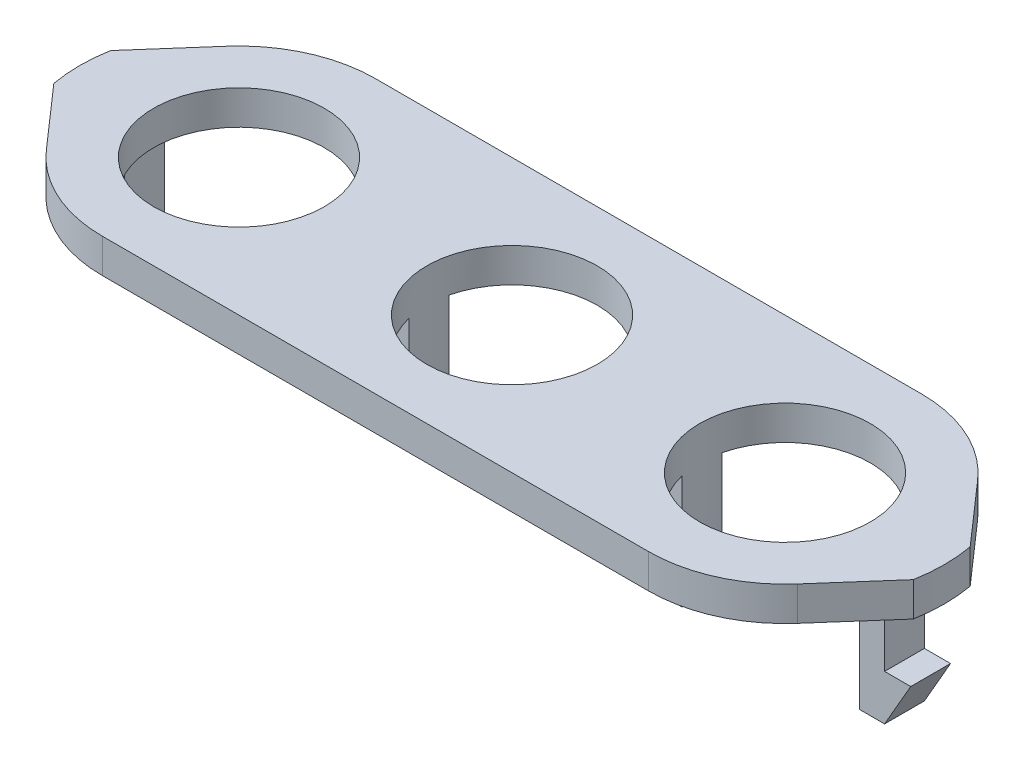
ISO-10303-21;
HEADER;
FILE_DESCRIPTION(('STEP AP214'),'2;1');
FILE_NAME('part.step','',(''),(''),'','','');
FILE_SCHEMA(('AUTOMOTIVE_DESIGN { 1 0 10303 214 1 1 1 1 }'));
ENDSEC;
DATA;
#1=APPLICATION_CONTEXT('core data for automotive mechanical design processes');
#2=APPLICATION_PROTOCOL_DEFINITION('international standard','automotive_design',2000,#1);
#3=PRODUCT_CONTEXT('',#1,'mechanical');
#4=PRODUCT('Part','Part','',(#3));
#5=PRODUCT_RELATED_PRODUCT_CATEGORY('part','',(#4));
#6=PRODUCT_DEFINITION_FORMATION('','',#4);
#7=PRODUCT_DEFINITION_CONTEXT('part definition',#1,'design');
#8=PRODUCT_DEFINITION('design','',#6,#7);
#9=PRODUCT_DEFINITION_SHAPE('','',#8);
#10=(LENGTH_UNIT() NAMED_UNIT(*) SI_UNIT(.MILLI.,.METRE.));
#11=(NAMED_UNIT(*) PLANE_ANGLE_UNIT() SI_UNIT($,.RADIAN.));
#12=(NAMED_UNIT(*) SI_UNIT($,.STERADIAN.) SOLID_ANGLE_UNIT());
#13=UNCERTAINTY_MEASURE_WITH_UNIT(LENGTH_MEASURE(1.E-05),#10,'distance_accuracy_value','');
#14=(GEOMETRIC_REPRESENTATION_CONTEXT(3) GLOBAL_UNCERTAINTY_ASSIGNED_CONTEXT((#13)) GLOBAL_UNIT_ASSIGNED_CONTEXT((#10,
#11,#12)) REPRESENTATION_CONTEXT('',''));
#15=CARTESIAN_POINT('',(0.,0.,0.));
#16=DIRECTION('',(0.,0.,1.));
#17=DIRECTION('',(1.,0.,0.));
#18=AXIS2_PLACEMENT_3D('',#15,#16,#17);
#19=CARTESIAN_POINT('',(34.5,-10.,-1.75));
#20=DIRECTION('',(0.,0.,1.));
#21=DIRECTION('',(1.,0.,0.));
#22=AXIS2_PLACEMENT_3D('',#19,#20,#21);
#23=PLANE('',#22);
#24=DIRECTION('',(0.,-1.,0.));
#25=VECTOR('',#24,1.);
#26=CARTESIAN_POINT('',(32.2929760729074,3.64005494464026,-1.75));
#27=LINE('',#26,#25);
#28=CARTESIAN_POINT('',(32.2929760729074,0.,-1.75));
#29=VERTEX_POINT('',#28);
#30=CARTESIAN_POINT('',(32.2929760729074,-10.,-1.75));
#31=VERTEX_POINT('',#30);
#32=EDGE_CURVE('E51',#29,#31,#27,.T.);
#33=ORIENTED_EDGE('',*,*,#32,.F.);
#34=DIRECTION('',(1.,0.,0.));
#35=VECTOR('',#34,1.);
#36=CARTESIAN_POINT('',(34.5,0.,-1.75));
#37=LINE('',#36,#35);
#38=CARTESIAN_POINT('',(34.5,0.,-1.75));
#39=VERTEX_POINT('',#38);
#40=EDGE_CURVE('E255',#29,#39,#37,.T.);
#41=ORIENTED_EDGE('',*,*,#40,.T.);
#42=DIRECTION('',(0.,1.,0.));
#43=VECTOR('',#42,1.);
#44=CARTESIAN_POINT('',(34.5,-10.,-1.75));
#45=LINE('',#44,#43);
#46=CARTESIAN_POINT('',(34.5,-6.,-1.75));
#47=VERTEX_POINT('',#46);
#48=EDGE_CURVE('E278',#47,#39,#45,.T.);
#49=ORIENTED_EDGE('',*,*,#48,.F.);
#50=DIRECTION('',(1.,0.,0.));
#51=VECTOR('',#50,1.);
#52=CARTESIAN_POINT('',(34.5,-6.,-1.75));
#53=LINE('',#52,#51);
#54=CARTESIAN_POINT('',(36.8,-6.,-1.75));
#55=VERTEX_POINT('',#54);
#56=EDGE_CURVE('E475',#47,#55,#53,.T.);
#57=ORIENTED_EDGE('',*,*,#56,.T.);
#58=DIRECTION('',(-0.498471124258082,-0.866906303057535,0.));
#59=VECTOR('',#58,1.);
#60=CARTESIAN_POINT('',(34.5,-9.99999999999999,-1.75));
#61=LINE('',#60,#59);
#62=CARTESIAN_POINT('',(34.5,-9.99999999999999,-1.75));
#63=VERTEX_POINT('',#62);
#64=EDGE_CURVE('E479',#55,#63,#61,.T.);
#65=ORIENTED_EDGE('',*,*,#64,.T.);
#66=DIRECTION('',(1.,0.,0.));
#67=VECTOR('',#66,1.);
#68=CARTESIAN_POINT('',(34.5,-10.,-1.75));
#69=LINE('',#68,#67);
#70=EDGE_CURVE('E258',#31,#63,#69,.T.);
#71=ORIENTED_EDGE('',*,*,#70,.F.);
#72=EDGE_LOOP('',(#33,#41,#49,#57,#65,#71));
#73=FACE_BOUND('',#72,.T.);
#74=ADVANCED_FACE('F33',(#73),#23,.F.);
#75=CARTESIAN_POINT('',(34.5,-10.,1.75));
#76=DIRECTION('',(0.,0.,-1.));
#77=DIRECTION('',(-1.,0.,0.));
#78=AXIS2_PLACEMENT_3D('',#75,#76,#77);
#79=PLANE('',#78);
#80=DIRECTION('',(0.,-1.,0.));
#81=VECTOR('',#80,1.);
#82=CARTESIAN_POINT('',(32.2929760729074,3.64005494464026,1.75));
#83=LINE('',#82,#81);
#84=CARTESIAN_POINT('',(32.2929760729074,0.,1.75));
#85=VERTEX_POINT('',#84);
#86=CARTESIAN_POINT('',(32.2929760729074,-10.,1.75));
#87=VERTEX_POINT('',#86);
#88=EDGE_CURVE('E245',#85,#87,#83,.T.);
#89=ORIENTED_EDGE('',*,*,#88,.T.);
#90=DIRECTION('',(-1.,0.,0.));
#91=VECTOR('',#90,1.);
#92=CARTESIAN_POINT('',(34.5,-10.,1.75));
#93=LINE('',#92,#91);
#94=CARTESIAN_POINT('',(34.5,-10.,1.75));
#95=VERTEX_POINT('',#94);
#96=EDGE_CURVE('E272',#95,#87,#93,.T.);
#97=ORIENTED_EDGE('',*,*,#96,.F.);
#98=DIRECTION('',(0.498471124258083,0.866906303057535,0.));
#99=VECTOR('',#98,1.);
#100=CARTESIAN_POINT('',(34.5,-9.99999999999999,1.75));
#101=LINE('',#100,#99);
#102=CARTESIAN_POINT('',(36.8,-6.,1.75));
#103=VERTEX_POINT('',#102);
#104=EDGE_CURVE('E486',#95,#103,#101,.T.);
#105=ORIENTED_EDGE('',*,*,#104,.T.);
#106=DIRECTION('',(-1.,0.,0.));
#107=VECTOR('',#106,1.);
#108=CARTESIAN_POINT('',(34.5,-6.,1.75));
#109=LINE('',#108,#107);
#110=CARTESIAN_POINT('',(34.5,-6.,1.75));
#111=VERTEX_POINT('',#110);
#112=EDGE_CURVE('E487',#103,#111,#109,.T.);
#113=ORIENTED_EDGE('',*,*,#112,.T.);
#114=DIRECTION('',(0.,1.,0.));
#115=VECTOR('',#114,1.);
#116=CARTESIAN_POINT('',(34.5,-10.,1.75));
#117=LINE('',#116,#115);
#118=CARTESIAN_POINT('',(34.5,0.,1.75));
#119=VERTEX_POINT('',#118);
#120=EDGE_CURVE('E276',#111,#119,#117,.T.);
#121=ORIENTED_EDGE('',*,*,#120,.T.);
#122=DIRECTION('',(-1.,0.,0.));
#123=VECTOR('',#122,1.);
#124=CARTESIAN_POINT('',(34.5,0.,1.75));
#125=LINE('',#124,#123);
#126=EDGE_CURVE('E267',#119,#85,#125,.T.);
#127=ORIENTED_EDGE('',*,*,#126,.T.);
#128=EDGE_LOOP('',(#89,#97,#105,#113,#121,#127));
#129=FACE_BOUND('',#128,.T.);
#130=ADVANCED_FACE('F515',(#129),#79,.F.);
#131=CARTESIAN_POINT('',(24.,-10.,0.));
#132=DIRECTION('',(0.,-1.,0.));
#133=DIRECTION('',(0.,0.,-1.));
#134=AXIS2_PLACEMENT_3D('',#131,#132,#133);
#135=PLANE('',#134);
#136=ORIENTED_EDGE('',*,*,#96,.T.);
#137=DIRECTION('',(0.,0.,-1.));
#138=VECTOR('',#137,1.);
#139=CARTESIAN_POINT('',(32.2929760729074,-10.,1.75));
#140=LINE('',#139,#138);
#141=EDGE_CURVE('E513',#87,#31,#140,.T.);
#142=ORIENTED_EDGE('',*,*,#141,.T.);
#143=ORIENTED_EDGE('',*,*,#70,.T.);
#144=DIRECTION('',(0.,0.,1.));
#145=VECTOR('',#144,1.);
#146=CARTESIAN_POINT('',(34.5,-10.,-1.75));
#147=LINE('',#146,#145);
#148=EDGE_CURVE('E506',#63,#95,#147,.T.);
#149=ORIENTED_EDGE('',*,*,#148,.T.);
#150=EDGE_LOOP('',(#136,#142,#143,#149));
#151=FACE_BOUND('',#150,.T.);
#152=ADVANCED_FACE('F512',(#151),#135,.T.);
#153=CARTESIAN_POINT('',(0.,0.,0.));
#154=DIRECTION('',(0.,1.,0.));
#155=DIRECTION('',(0.,0.,1.));
#156=AXIS2_PLACEMENT_3D('',#153,#154,#155);
#157=PLANE('',#156);
#158=ORIENTED_EDGE('',*,*,#40,.F.);
#159=DIRECTION('',(0.,0.,-1.));
#160=VECTOR('',#159,1.);
#161=CARTESIAN_POINT('',(32.2929760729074,0.,1.75));
#162=LINE('',#161,#160);
#163=EDGE_CURVE('E242',#85,#29,#162,.T.);
#164=ORIENTED_EDGE('',*,*,#163,.F.);
#165=ORIENTED_EDGE('',*,*,#126,.F.);
#166=DIRECTION('',(0.,0.,1.));
#167=VECTOR('',#166,1.);
#168=CARTESIAN_POINT('',(34.5,0.,1.75));
#169=LINE('',#168,#167);
#170=EDGE_CURVE('E264',#39,#119,#169,.T.);
#171=ORIENTED_EDGE('',*,*,#170,.F.);
#172=EDGE_LOOP('',(#158,#164,#165,#171));
#173=FACE_BOUND('',#172,.T.);
#174=CARTESIAN_POINT('',(-24.,0.,0.));
#175=DIRECTION('',(0.,1.,0.));
#176=DIRECTION('',(0.,0.,1.));
#177=AXIS2_PLACEMENT_3D('',#174,#175,#176);
#178=CIRCLE('',#177,7.5);
#179=CARTESIAN_POINT('',(-16.7070239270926,0.,1.75));
#180=VERTEX_POINT('',#179);
#181=CARTESIAN_POINT('',(-16.7070239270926,0.,-1.75));
#182=VERTEX_POINT('',#181);
#183=EDGE_CURVE('E348',#180,#182,#178,.F.);
#184=ORIENTED_EDGE('',*,*,#183,.F.);
#185=DIRECTION('',(-1.,0.,0.));
#186=VECTOR('',#185,1.);
#187=CARTESIAN_POINT('',(-7.29297607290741,0.,1.75));
#188=LINE('',#187,#186);
#189=CARTESIAN_POINT('',(-7.29297607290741,0.,1.75));
#190=VERTEX_POINT('',#189);
#191=EDGE_CURVE('E309',#190,#180,#188,.T.);
#192=ORIENTED_EDGE('',*,*,#191,.F.);
#193=CARTESIAN_POINT('',(0.,0.,0.));
#194=DIRECTION('',(0.,1.,0.));
#195=DIRECTION('',(0.,0.,1.));
#196=AXIS2_PLACEMENT_3D('',#193,#194,#195);
#197=CIRCLE('',#196,7.5);
#198=CARTESIAN_POINT('',(7.29297607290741,0.,1.75));
#199=VERTEX_POINT('',#198);
#200=EDGE_CURVE('E352',#190,#199,#197,.T.);
#201=ORIENTED_EDGE('',*,*,#200,.T.);
#202=DIRECTION('',(-1.,0.,0.));
#203=VECTOR('',#202,1.);
#204=CARTESIAN_POINT('',(16.7070239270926,0.,1.75));
#205=LINE('',#204,#203);
#206=CARTESIAN_POINT('',(16.7070239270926,0.,1.75));
#207=VERTEX_POINT('',#206);
#208=EDGE_CURVE('E280',#207,#199,#205,.T.);
#209=ORIENTED_EDGE('',*,*,#208,.F.);
#210=CARTESIAN_POINT('',(24.,0.,0.));
#211=DIRECTION('',(0.,1.,0.));
#212=DIRECTION('',(0.,0.,1.));
#213=AXIS2_PLACEMENT_3D('',#210,#211,#212);
#214=CIRCLE('',#213,7.5);
#215=CARTESIAN_POINT('',(16.7070239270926,0.,-1.75));
#216=VERTEX_POINT('',#215);
#217=EDGE_CURVE('E351',#216,#207,#214,.F.);
#218=ORIENTED_EDGE('',*,*,#217,.F.);
#219=DIRECTION('',(1.,0.,0.));
#220=VECTOR('',#219,1.);
#221=CARTESIAN_POINT('',(16.7070239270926,0.,-1.75));
#222=LINE('',#221,#220);
#223=CARTESIAN_POINT('',(7.29297607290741,0.,-1.75));
#224=VERTEX_POINT('',#223);
#225=EDGE_CURVE('E285',#224,#216,#222,.T.);
#226=ORIENTED_EDGE('',*,*,#225,.F.);
#227=CARTESIAN_POINT('',(-7.29297607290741,0.,-1.75));
#228=VERTEX_POINT('',#227);
#229=EDGE_CURVE('E382',#224,#228,#197,.T.);
#230=ORIENTED_EDGE('',*,*,#229,.T.);
#231=DIRECTION('',(1.,0.,0.));
#232=VECTOR('',#231,1.);
#233=CARTESIAN_POINT('',(-7.29297607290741,0.,-1.75));
#234=LINE('',#233,#232);
#235=EDGE_CURVE('E304',#182,#228,#234,.T.);
#236=ORIENTED_EDGE('',*,*,#235,.F.);
#237=EDGE_LOOP('',(#184,#192,#201,#209,#218,#226,#230,#236));
#238=FACE_BOUND('',#237,.T.);
#239=CARTESIAN_POINT('',(-24.,0.,0.));
#240=DIRECTION('',(0.,1.,0.));
#241=DIRECTION('',(0.,0.,1.));
#242=AXIS2_PLACEMENT_3D('',#239,#240,#241);
#243=CIRCLE('',#242,12.);
#244=CARTESIAN_POINT('',(-24.,0.,12.));
#245=VERTEX_POINT('',#244);
#246=CARTESIAN_POINT('',(-33.0166513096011,0.,7.91833310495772));
#247=VERTEX_POINT('',#246);
#248=EDGE_CURVE('E415',#245,#247,#243,.F.);
#249=ORIENTED_EDGE('',*,*,#248,.T.);
#250=DIRECTION('',(0.65986109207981,0.,0.751387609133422));
#251=VECTOR('',#250,1.);
#252=CARTESIAN_POINT('',(-22.5666514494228,0.,19.8178078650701));
#253=LINE('',#252,#251);
#254=CARTESIAN_POINT('',(-37.7749773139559,0.,2.5));
#255=VERTEX_POINT('',#254);
#256=EDGE_CURVE('E383',#255,#247,#253,.T.);
#257=ORIENTED_EDGE('',*,*,#256,.F.);
#258=CARTESIAN_POINT('',(-24.,0.,0.));
#259=DIRECTION('',(0.,1.,0.));
#260=DIRECTION('',(0.,0.,1.));
#261=AXIS2_PLACEMENT_3D('',#258,#259,#260);
#262=CIRCLE('',#261,14.);
#263=CARTESIAN_POINT('',(-37.7749773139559,0.,-2.5));
#264=VERTEX_POINT('',#263);
#265=EDGE_CURVE('E386',#255,#264,#262,.F.);
#266=ORIENTED_EDGE('',*,*,#265,.T.);
#267=DIRECTION('',(0.65986109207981,0.,-0.751387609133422));
#268=VECTOR('',#267,1.);
#269=CARTESIAN_POINT('',(-22.5666514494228,0.,-19.8178078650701));
#270=LINE('',#269,#268);
#271=CARTESIAN_POINT('',(-33.0166513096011,0.,-7.91833310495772));
#272=VERTEX_POINT('',#271);
#273=EDGE_CURVE('E389',#264,#272,#270,.T.);
#274=ORIENTED_EDGE('',*,*,#273,.T.);
#275=CARTESIAN_POINT('',(-24.,0.,0.));
#276=DIRECTION('',(0.,1.,0.));
#277=DIRECTION('',(0.,0.,1.));
#278=AXIS2_PLACEMENT_3D('',#275,#276,#277);
#279=CIRCLE('',#278,12.);
#280=CARTESIAN_POINT('',(-23.9999999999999,0.,-12.));
#281=VERTEX_POINT('',#280);
#282=EDGE_CURVE('E392',#272,#281,#279,.F.);
#283=ORIENTED_EDGE('',*,*,#282,.T.);
#284=DIRECTION('',(-1.,0.,0.));
#285=VECTOR('',#284,1.);
#286=CARTESIAN_POINT('',(0.,0.,-12.));
#287=LINE('',#286,#285);
#288=CARTESIAN_POINT('',(24.0000000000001,0.,-12.));
#289=VERTEX_POINT('',#288);
#290=EDGE_CURVE('E395',#289,#281,#287,.T.);
#291=ORIENTED_EDGE('',*,*,#290,.F.);
#292=CARTESIAN_POINT('',(24.,0.,0.));
#293=DIRECTION('',(0.,1.,0.));
#294=DIRECTION('',(0.,0.,1.));
#295=AXIS2_PLACEMENT_3D('',#292,#293,#294);
#296=CIRCLE('',#295,12.);
#297=CARTESIAN_POINT('',(33.0166513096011,0.,-7.91833310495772));
#298=VERTEX_POINT('',#297);
#299=EDGE_CURVE('E398',#289,#298,#296,.F.);
#300=ORIENTED_EDGE('',*,*,#299,.T.);
#301=DIRECTION('',(-0.65986109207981,0.,-0.751387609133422));
#302=VECTOR('',#301,1.);
#303=CARTESIAN_POINT('',(22.5666514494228,0.,-19.8178078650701));
#304=LINE('',#303,#302);
#305=CARTESIAN_POINT('',(37.7749773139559,0.,-2.5));
#306=VERTEX_POINT('',#305);
#307=EDGE_CURVE('E401',#306,#298,#304,.T.);
#308=ORIENTED_EDGE('',*,*,#307,.F.);
#309=CARTESIAN_POINT('',(24.,0.,0.));
#310=DIRECTION('',(0.,1.,0.));
#311=DIRECTION('',(0.,0.,1.));
#312=AXIS2_PLACEMENT_3D('',#309,#310,#311);
#313=CIRCLE('',#312,14.);
#314=CARTESIAN_POINT('',(37.7749773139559,0.,2.5));
#315=VERTEX_POINT('',#314);
#316=EDGE_CURVE('E404',#315,#306,#313,.T.);
#317=ORIENTED_EDGE('',*,*,#316,.F.);
#318=DIRECTION('',(-0.65986109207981,0.,0.751387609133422));
#319=VECTOR('',#318,1.);
#320=CARTESIAN_POINT('',(22.5666514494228,0.,19.8178078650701));
#321=LINE('',#320,#319);
#322=CARTESIAN_POINT('',(33.0166513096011,0.,7.91833310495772));
#323=VERTEX_POINT('',#322);
#324=EDGE_CURVE('E406',#315,#323,#321,.T.);
#325=ORIENTED_EDGE('',*,*,#324,.T.);
#326=CARTESIAN_POINT('',(24.,0.,0.));
#327=DIRECTION('',(0.,1.,0.));
#328=DIRECTION('',(0.,0.,1.));
#329=AXIS2_PLACEMENT_3D('',#326,#327,#328);
#330=CIRCLE('',#329,12.);
#331=CARTESIAN_POINT('',(24.,0.,12.));
#332=VERTEX_POINT('',#331);
#333=EDGE_CURVE('E409',#323,#332,#330,.F.);
#334=ORIENTED_EDGE('',*,*,#333,.T.);
#335=DIRECTION('',(-1.,0.,0.));
#336=VECTOR('',#335,1.);
#337=CARTESIAN_POINT('',(0.,0.,12.));
#338=LINE('',#337,#336);
#339=EDGE_CURVE('E412',#332,#245,#338,.T.);
#340=ORIENTED_EDGE('',*,*,#339,.T.);
#341=EDGE_LOOP('',(#249,#257,#266,#274,#283,#291,#300,#308,#317,#325,#334,#340));
#342=FACE_BOUND('',#341,.T.);
#343=DIRECTION('',(0.,0.,-1.));
#344=VECTOR('',#343,1.);
#345=CARTESIAN_POINT('',(-32.2929760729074,0.,0.));
#346=LINE('',#345,#344);
#347=CARTESIAN_POINT('',(-32.2929760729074,0.,1.75));
#348=VERTEX_POINT('',#347);
#349=CARTESIAN_POINT('',(-32.2929760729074,0.,-1.75));
#350=VERTEX_POINT('',#349);
#351=EDGE_CURVE('E482',#348,#350,#346,.T.);
#352=ORIENTED_EDGE('',*,*,#351,.T.);
#353=DIRECTION('',(1.,0.,0.));
#354=VECTOR('',#353,1.);
#355=CARTESIAN_POINT('',(-31.2929760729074,0.,-1.75));
#356=LINE('',#355,#354);
#357=CARTESIAN_POINT('',(-34.5,0.,-1.75));
#358=VERTEX_POINT('',#357);
#359=EDGE_CURVE('E331',#358,#350,#356,.T.);
#360=ORIENTED_EDGE('',*,*,#359,.F.);
#361=DIRECTION('',(0.,0.,-1.));
#362=VECTOR('',#361,1.);
#363=CARTESIAN_POINT('',(-34.5,0.,1.75));
#364=LINE('',#363,#362);
#365=CARTESIAN_POINT('',(-34.5,0.,1.75));
#366=VERTEX_POINT('',#365);
#367=EDGE_CURVE('E336',#366,#358,#364,.T.);
#368=ORIENTED_EDGE('',*,*,#367,.F.);
#369=DIRECTION('',(-1.,0.,0.));
#370=VECTOR('',#369,1.);
#371=CARTESIAN_POINT('',(-31.2929760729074,0.,1.75));
#372=LINE('',#371,#370);
#373=EDGE_CURVE('E37',#348,#366,#372,.T.);
#374=ORIENTED_EDGE('',*,*,#373,.F.);
#375=EDGE_LOOP('',(#352,#360,#368,#374));
#376=FACE_BOUND('',#375,.T.);
#377=ADVANCED_FACE('F261',(#173,#238,#342,#376),#157,.F.);
#378=CARTESIAN_POINT('',(-24.,3.,0.));
#379=DIRECTION('',(0.,-1.,0.));
#380=DIRECTION('',(0.,0.,-1.));
#381=AXIS2_PLACEMENT_3D('',#378,#379,#380);
#382=CYLINDRICAL_SURFACE('',#381,12.);
#383=ORIENTED_EDGE('',*,*,#248,.F.);
#384=DIRECTION('',(0.,-1.,0.));
#385=VECTOR('',#384,1.);
#386=CARTESIAN_POINT('',(-24.,3.,12.));
#387=LINE('',#386,#385);
#388=CARTESIAN_POINT('',(-24.,3.,12.));
#389=VERTEX_POINT('',#388);
#390=EDGE_CURVE('E11',#389,#245,#387,.T.);
#391=ORIENTED_EDGE('',*,*,#390,.F.);
#392=CARTESIAN_POINT('',(-24.,3.,0.));
#393=DIRECTION('',(0.,1.,0.));
#394=DIRECTION('',(0.,0.,1.));
#395=AXIS2_PLACEMENT_3D('',#392,#393,#394);
#396=CIRCLE('',#395,12.);
#397=CARTESIAN_POINT('',(-33.0166513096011,3.,7.91833310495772));
#398=VERTEX_POINT('',#397);
#399=EDGE_CURVE('E379',#389,#398,#396,.F.);
#400=ORIENTED_EDGE('',*,*,#399,.T.);
#401=DIRECTION('',(0.,-1.,0.));
#402=VECTOR('',#401,1.);
#403=CARTESIAN_POINT('',(-33.0166513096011,3.,7.91833310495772));
#404=LINE('',#403,#402);
#405=EDGE_CURVE('E375',#398,#247,#404,.T.);
#406=ORIENTED_EDGE('',*,*,#405,.T.);
#407=EDGE_LOOP('',(#383,#391,#400,#406));
#408=FACE_BOUND('',#407,.T.);
#409=ADVANCED_FACE('F35',(#408),#382,.T.);
#410=CARTESIAN_POINT('',(0.,3.,12.));
#411=DIRECTION('',(0.,0.,1.));
#412=DIRECTION('',(1.,0.,0.));
#413=AXIS2_PLACEMENT_3D('',#410,#411,#412);
#414=PLANE('',#413);
#415=ORIENTED_EDGE('',*,*,#339,.F.);
#416=DIRECTION('',(0.,-1.,0.));
#417=VECTOR('',#416,1.);
#418=CARTESIAN_POINT('',(24.,3.,12.));
#419=LINE('',#418,#417);
#420=CARTESIAN_POINT('',(24.,3.,12.));
#421=VERTEX_POINT('',#420);
#422=EDGE_CURVE('E43',#421,#332,#419,.T.);
#423=ORIENTED_EDGE('',*,*,#422,.F.);
#424=DIRECTION('',(-1.,0.,0.));
#425=VECTOR('',#424,1.);
#426=CARTESIAN_POINT('',(0.,3.,12.));
#427=LINE('',#426,#425);
#428=EDGE_CURVE('E453',#421,#389,#427,.T.);
#429=ORIENTED_EDGE('',*,*,#428,.T.);
#430=ORIENTED_EDGE('',*,*,#390,.T.);
#431=EDGE_LOOP('',(#415,#423,#429,#430));
#432=FACE_BOUND('',#431,.T.);
#433=ADVANCED_FACE('F644',(#432),#414,.T.);
#434=CARTESIAN_POINT('',(24.,3.,0.));
#435=DIRECTION('',(0.,-1.,0.));
#436=DIRECTION('',(0.,0.,-1.));
#437=AXIS2_PLACEMENT_3D('',#434,#435,#436);
#438=CYLINDRICAL_SURFACE('',#437,12.);
#439=ORIENTED_EDGE('',*,*,#333,.F.);
#440=DIRECTION('',(0.,-1.,0.));
#441=VECTOR('',#440,1.);
#442=CARTESIAN_POINT('',(33.0166513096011,3.,7.91833310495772));
#443=LINE('',#442,#441);
#444=CARTESIAN_POINT('',(33.0166513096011,3.,7.91833310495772));
#445=VERTEX_POINT('',#444);
#446=EDGE_CURVE('E356',#445,#323,#443,.T.);
#447=ORIENTED_EDGE('',*,*,#446,.F.);
#448=CARTESIAN_POINT('',(24.,3.,0.));
#449=DIRECTION('',(0.,1.,0.));
#450=DIRECTION('',(0.,0.,1.));
#451=AXIS2_PLACEMENT_3D('',#448,#449,#450);
#452=CIRCLE('',#451,12.);
#453=EDGE_CURVE('E450',#445,#421,#452,.F.);
#454=ORIENTED_EDGE('',*,*,#453,.T.);
#455=ORIENTED_EDGE('',*,*,#422,.T.);
#456=EDGE_LOOP('',(#439,#447,#454,#455));
#457=FACE_BOUND('',#456,.T.);
#458=ADVANCED_FACE('F641',(#457),#438,.T.);
#459=CARTESIAN_POINT('',(22.5666514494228,3.,19.8178078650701));
#460=DIRECTION('',(0.751387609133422,0.,0.65986109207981));
#461=DIRECTION('',(0.65986109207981,0.,-0.751387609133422));
#462=AXIS2_PLACEMENT_3D('',#459,#460,#461);
#463=PLANE('',#462);
#464=ORIENTED_EDGE('',*,*,#324,.F.);
#465=DIRECTION('',(0.,-1.,0.));
#466=VECTOR('',#465,1.);
#467=CARTESIAN_POINT('',(37.7749773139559,3.,2.5));
#468=LINE('',#467,#466);
#469=CARTESIAN_POINT('',(37.7749773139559,3.,2.5));
#470=VERTEX_POINT('',#469);
#471=EDGE_CURVE('E358',#470,#315,#468,.T.);
#472=ORIENTED_EDGE('',*,*,#471,.F.);
#473=DIRECTION('',(-0.65986109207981,0.,0.751387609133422));
#474=VECTOR('',#473,1.);
#475=CARTESIAN_POINT('',(22.5666514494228,3.,19.8178078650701));
#476=LINE('',#475,#474);
#477=EDGE_CURVE('E447',#470,#445,#476,.T.);
#478=ORIENTED_EDGE('',*,*,#477,.T.);
#479=ORIENTED_EDGE('',*,*,#446,.T.);
#480=EDGE_LOOP('',(#464,#472,#478,#479));
#481=FACE_BOUND('',#480,.T.);
#482=ADVANCED_FACE('F637',(#481),#463,.T.);
#483=CARTESIAN_POINT('',(24.,3.,0.));
#484=DIRECTION('',(0.,-1.,0.));
#485=DIRECTION('',(0.,0.,-1.));
#486=AXIS2_PLACEMENT_3D('',#483,#484,#485);
#487=CYLINDRICAL_SURFACE('',#486,14.);
#488=ORIENTED_EDGE('',*,*,#316,.T.);
#489=DIRECTION('',(0.,-1.,0.));
#490=VECTOR('',#489,1.);
#491=CARTESIAN_POINT('',(37.7749773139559,3.,-2.5));
#492=LINE('',#491,#490);
#493=CARTESIAN_POINT('',(37.7749773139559,3.,-2.5));
#494=VERTEX_POINT('',#493);
#495=EDGE_CURVE('E360',#494,#306,#492,.T.);
#496=ORIENTED_EDGE('',*,*,#495,.F.);
#497=CARTESIAN_POINT('',(24.,3.,0.));
#498=DIRECTION('',(0.,1.,0.));
#499=DIRECTION('',(0.,0.,1.));
#500=AXIS2_PLACEMENT_3D('',#497,#498,#499);
#501=CIRCLE('',#500,14.);
#502=EDGE_CURVE('E445',#470,#494,#501,.T.);
#503=ORIENTED_EDGE('',*,*,#502,.F.);
#504=ORIENTED_EDGE('',*,*,#471,.T.);
#505=EDGE_LOOP('',(#488,#496,#503,#504));
#506=FACE_BOUND('',#505,.T.);
#507=ADVANCED_FACE('F633',(#506),#487,.T.);
#508=CARTESIAN_POINT('',(22.5666514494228,3.,-19.8178078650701));
#509=DIRECTION('',(-0.751387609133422,0.,0.65986109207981));
#510=DIRECTION('',(0.65986109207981,0.,0.751387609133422));
#511=AXIS2_PLACEMENT_3D('',#508,#509,#510);
#512=PLANE('',#511);
#513=ORIENTED_EDGE('',*,*,#307,.T.);
#514=DIRECTION('',(0.,-1.,0.));
#515=VECTOR('',#514,1.);
#516=CARTESIAN_POINT('',(33.0166513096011,3.,-7.91833310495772));
#517=LINE('',#516,#515);
#518=CARTESIAN_POINT('',(33.0166513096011,3.,-7.91833310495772));
#519=VERTEX_POINT('',#518);
#520=EDGE_CURVE('E363',#519,#298,#517,.T.);
#521=ORIENTED_EDGE('',*,*,#520,.F.);
#522=DIRECTION('',(-0.65986109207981,0.,-0.751387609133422));
#523=VECTOR('',#522,1.);
#524=CARTESIAN_POINT('',(22.5666514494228,3.,-19.8178078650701));
#525=LINE('',#524,#523);
#526=EDGE_CURVE('E443',#494,#519,#525,.T.);
#527=ORIENTED_EDGE('',*,*,#526,.F.);
#528=ORIENTED_EDGE('',*,*,#495,.T.);
#529=EDGE_LOOP('',(#513,#521,#527,#528));
#530=FACE_BOUND('',#529,.T.);
#531=ADVANCED_FACE('F629',(#530),#512,.F.);
#532=CARTESIAN_POINT('',(24.,3.,0.));
#533=DIRECTION('',(0.,-1.,0.));
#534=DIRECTION('',(0.,0.,-1.));
#535=AXIS2_PLACEMENT_3D('',#532,#533,#534);
#536=CYLINDRICAL_SURFACE('',#535,12.);
#537=ORIENTED_EDGE('',*,*,#299,.F.);
#538=DIRECTION('',(0.,-1.,0.));
#539=VECTOR('',#538,1.);
#540=CARTESIAN_POINT('',(24.0000000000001,3.,-12.));
#541=LINE('',#540,#539);
#542=CARTESIAN_POINT('',(24.0000000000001,3.,-12.));
#543=VERTEX_POINT('',#542);
#544=EDGE_CURVE('E365',#543,#289,#541,.T.);
#545=ORIENTED_EDGE('',*,*,#544,.F.);
#546=CARTESIAN_POINT('',(24.,3.,0.));
#547=DIRECTION('',(0.,1.,0.));
#548=DIRECTION('',(0.,0.,1.));
#549=AXIS2_PLACEMENT_3D('',#546,#547,#548);
#550=CIRCLE('',#549,12.);
#551=EDGE_CURVE('E440',#543,#519,#550,.F.);
#552=ORIENTED_EDGE('',*,*,#551,.T.);
#553=ORIENTED_EDGE('',*,*,#520,.T.);
#554=EDGE_LOOP('',(#537,#545,#552,#553));
#555=FACE_BOUND('',#554,.T.);
#556=ADVANCED_FACE('F625',(#555),#536,.T.);
#557=CARTESIAN_POINT('',(0.,3.,-12.));
#558=DIRECTION('',(0.,0.,1.));
#559=DIRECTION('',(1.,0.,0.));
#560=AXIS2_PLACEMENT_3D('',#557,#558,#559);
#561=PLANE('',#560);
#562=ORIENTED_EDGE('',*,*,#290,.T.);
#563=DIRECTION('',(0.,-1.,0.));
#564=VECTOR('',#563,1.);
#565=CARTESIAN_POINT('',(-23.9999999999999,3.,-12.));
#566=LINE('',#565,#564);
#567=CARTESIAN_POINT('',(-23.9999999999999,3.,-12.));
#568=VERTEX_POINT('',#567);
#569=EDGE_CURVE('E367',#568,#281,#566,.T.);
#570=ORIENTED_EDGE('',*,*,#569,.F.);
#571=DIRECTION('',(-1.,0.,0.));
#572=VECTOR('',#571,1.);
#573=CARTESIAN_POINT('',(0.,3.,-12.));
#574=LINE('',#573,#572);
#575=EDGE_CURVE('E438',#543,#568,#574,.T.);
#576=ORIENTED_EDGE('',*,*,#575,.F.);
#577=ORIENTED_EDGE('',*,*,#544,.T.);
#578=EDGE_LOOP('',(#562,#570,#576,#577));
#579=FACE_BOUND('',#578,.T.);
#580=ADVANCED_FACE('F621',(#579),#561,.F.);
#581=CARTESIAN_POINT('',(-24.,3.,0.));
#582=DIRECTION('',(0.,-1.,0.));
#583=DIRECTION('',(0.,0.,-1.));
#584=AXIS2_PLACEMENT_3D('',#581,#582,#583);
#585=CYLINDRICAL_SURFACE('',#584,12.);
#586=ORIENTED_EDGE('',*,*,#282,.F.);
#587=DIRECTION('',(0.,-1.,0.));
#588=VECTOR('',#587,1.);
#589=CARTESIAN_POINT('',(-33.0166513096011,3.,-7.91833310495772));
#590=LINE('',#589,#588);
#591=CARTESIAN_POINT('',(-33.0166513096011,3.,-7.91833310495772));
#592=VERTEX_POINT('',#591);
#593=EDGE_CURVE('E369',#592,#272,#590,.T.);
#594=ORIENTED_EDGE('',*,*,#593,.F.);
#595=CARTESIAN_POINT('',(-24.,3.,0.));
#596=DIRECTION('',(0.,1.,0.));
#597=DIRECTION('',(0.,0.,1.));
#598=AXIS2_PLACEMENT_3D('',#595,#596,#597);
#599=CIRCLE('',#598,12.);
#600=EDGE_CURVE('E435',#592,#568,#599,.F.);
#601=ORIENTED_EDGE('',*,*,#600,.T.);
#602=ORIENTED_EDGE('',*,*,#569,.T.);
#603=EDGE_LOOP('',(#586,#594,#601,#602));
#604=FACE_BOUND('',#603,.T.);
#605=ADVANCED_FACE('F617',(#604),#585,.T.);
#606=CARTESIAN_POINT('',(-22.5666514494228,3.,-19.8178078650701));
#607=DIRECTION('',(-0.751387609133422,0.,-0.65986109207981));
#608=DIRECTION('',(-0.65986109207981,0.,0.751387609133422));
#609=AXIS2_PLACEMENT_3D('',#606,#607,#608);
#610=PLANE('',#609);
#611=ORIENTED_EDGE('',*,*,#273,.F.);
#612=DIRECTION('',(0.,-1.,0.));
#613=VECTOR('',#612,1.);
#614=CARTESIAN_POINT('',(-37.7749773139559,3.,-2.5));
#615=LINE('',#614,#613);
#616=CARTESIAN_POINT('',(-37.7749773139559,3.,-2.5));
#617=VERTEX_POINT('',#616);
#618=EDGE_CURVE('E371',#617,#264,#615,.T.);
#619=ORIENTED_EDGE('',*,*,#618,.F.);
#620=DIRECTION('',(0.65986109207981,0.,-0.751387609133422));
#621=VECTOR('',#620,1.);
#622=CARTESIAN_POINT('',(-22.5666514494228,3.,-19.8178078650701));
#623=LINE('',#622,#621);
#624=EDGE_CURVE('E432',#617,#592,#623,.T.);
#625=ORIENTED_EDGE('',*,*,#624,.T.);
#626=ORIENTED_EDGE('',*,*,#593,.T.);
#627=EDGE_LOOP('',(#611,#619,#625,#626));
#628=FACE_BOUND('',#627,.T.);
#629=ADVANCED_FACE('F613',(#628),#610,.T.);
#630=CARTESIAN_POINT('',(-24.,3.,0.));
#631=DIRECTION('',(0.,-1.,0.));
#632=DIRECTION('',(0.,0.,-1.));
#633=AXIS2_PLACEMENT_3D('',#630,#631,#632);
#634=CYLINDRICAL_SURFACE('',#633,14.);
#635=ORIENTED_EDGE('',*,*,#265,.F.);
#636=DIRECTION('',(0.,-1.,0.));
#637=VECTOR('',#636,1.);
#638=CARTESIAN_POINT('',(-37.7749773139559,3.,2.5));
#639=LINE('',#638,#637);
#640=CARTESIAN_POINT('',(-37.7749773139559,3.,2.5));
#641=VERTEX_POINT('',#640);
#642=EDGE_CURVE('E373',#641,#255,#639,.T.);
#643=ORIENTED_EDGE('',*,*,#642,.F.);
#644=CARTESIAN_POINT('',(-24.,3.,0.));
#645=DIRECTION('',(0.,1.,0.));
#646=DIRECTION('',(0.,0.,1.));
#647=AXIS2_PLACEMENT_3D('',#644,#645,#646);
#648=CIRCLE('',#647,14.);
#649=EDGE_CURVE('E429',#641,#617,#648,.F.);
#650=ORIENTED_EDGE('',*,*,#649,.T.);
#651=ORIENTED_EDGE('',*,*,#618,.T.);
#652=EDGE_LOOP('',(#635,#643,#650,#651));
#653=FACE_BOUND('',#652,.T.);
#654=ADVANCED_FACE('F603',(#653),#634,.T.);
#655=CARTESIAN_POINT('',(-24.,3.,0.));
#656=DIRECTION('',(0.,-1.,0.));
#657=DIRECTION('',(0.,0.,-1.));
#658=AXIS2_PLACEMENT_3D('',#655,#656,#657);
#659=CYLINDRICAL_SURFACE('',#658,7.5);
#660=CARTESIAN_POINT('',(-24.,3.,0.));
#661=DIRECTION('',(0.,1.,0.));
#662=DIRECTION('',(0.,0.,1.));
#663=AXIS2_PLACEMENT_3D('',#660,#661,#662);
#664=CIRCLE('',#663,7.5);
#665=CARTESIAN_POINT('',(-24.,3.,7.5));
#666=VERTEX_POINT('',#665);
#667=EDGE_CURVE('E421',#666,#666,#664,.F.);
#668=ORIENTED_EDGE('',*,*,#667,.F.);
#669=EDGE_LOOP('',(#668));
#670=FACE_BOUND('',#669,.T.);
#671=DIRECTION('',(0.,1.,0.));
#672=VECTOR('',#671,1.);
#673=CARTESIAN_POINT('',(-16.7070239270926,-10.,1.75));
#674=LINE('',#673,#672);
#675=CARTESIAN_POINT('',(-16.7070239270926,-10.,1.75));
#676=VERTEX_POINT('',#675);
#677=EDGE_CURVE('E315',#676,#180,#674,.T.);
#678=ORIENTED_EDGE('',*,*,#677,.T.);
#679=ORIENTED_EDGE('',*,*,#183,.T.);
#680=DIRECTION('',(0.,1.,0.));
#681=VECTOR('',#680,1.);
#682=CARTESIAN_POINT('',(-16.7070239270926,-10.,-1.75));
#683=LINE('',#682,#681);
#684=CARTESIAN_POINT('',(-16.7070239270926,-10.,-1.75));
#685=VERTEX_POINT('',#684);
#686=EDGE_CURVE('E328',#685,#182,#683,.T.);
#687=ORIENTED_EDGE('',*,*,#686,.F.);
#688=CARTESIAN_POINT('',(-24.,-10.,0.));
#689=DIRECTION('',(0.,1.,0.));
#690=DIRECTION('',(0.,0.,-1.));
#691=AXIS2_PLACEMENT_3D('',#688,#689,#690);
#692=CIRCLE('',#691,7.5);
#693=EDGE_CURVE('E305',#676,#685,#692,.T.);
#694=ORIENTED_EDGE('',*,*,#693,.F.);
#695=EDGE_LOOP('',(#678,#679,#687,#694));
#696=FACE_BOUND('',#695,.T.);
#697=ADVANCED_FACE('F599',(#670,#696),#659,.F.);
#698=CARTESIAN_POINT('',(0.,3.,0.));
#699=DIRECTION('',(0.,-1.,0.));
#700=DIRECTION('',(0.,0.,-1.));
#701=AXIS2_PLACEMENT_3D('',#698,#699,#700);
#702=CYLINDRICAL_SURFACE('',#701,7.5);
#703=CARTESIAN_POINT('',(0.,3.,0.));
#704=DIRECTION('',(0.,1.,0.));
#705=DIRECTION('',(0.,0.,1.));
#706=AXIS2_PLACEMENT_3D('',#703,#704,#705);
#707=CIRCLE('',#706,7.5);
#708=CARTESIAN_POINT('',(0.,3.,7.5));
#709=VERTEX_POINT('',#708);
#710=EDGE_CURVE('E424',#709,#709,#707,.T.);
#711=ORIENTED_EDGE('',*,*,#710,.T.);
#712=EDGE_LOOP('',(#711));
#713=FACE_BOUND('',#712,.T.);
#714=ORIENTED_EDGE('',*,*,#200,.F.);
#715=DIRECTION('',(0.,1.,0.));
#716=VECTOR('',#715,1.);
#717=CARTESIAN_POINT('',(-7.29297607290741,-10.,1.75));
#718=LINE('',#717,#716);
#719=CARTESIAN_POINT('',(-7.29297607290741,-10.,1.75));
#720=VERTEX_POINT('',#719);
#721=EDGE_CURVE('E322',#720,#190,#718,.T.);
#722=ORIENTED_EDGE('',*,*,#721,.F.);
#723=CARTESIAN_POINT('',(0.,-10.,0.));
#724=DIRECTION('',(0.,1.,0.));
#725=DIRECTION('',(0.,0.,-1.));
#726=AXIS2_PLACEMENT_3D('',#723,#724,#725);
#727=CIRCLE('',#726,7.5);
#728=CARTESIAN_POINT('',(-7.29297607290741,-10.,-1.75));
#729=VERTEX_POINT('',#728);
#730=EDGE_CURVE('E311',#729,#720,#727,.T.);
#731=ORIENTED_EDGE('',*,*,#730,.F.);
#732=DIRECTION('',(0.,1.,0.));
#733=VECTOR('',#732,1.);
#734=CARTESIAN_POINT('',(-7.29297607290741,-10.,-1.75));
#735=LINE('',#734,#733);
#736=EDGE_CURVE('E325',#729,#228,#735,.T.);
#737=ORIENTED_EDGE('',*,*,#736,.T.);
#738=ORIENTED_EDGE('',*,*,#229,.F.);
#739=DIRECTION('',(0.,1.,0.));
#740=VECTOR('',#739,1.);
#741=CARTESIAN_POINT('',(7.29297607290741,-10.,-1.75));
#742=LINE('',#741,#740);
#743=CARTESIAN_POINT('',(7.29297607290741,-10.,-1.75));
#744=VERTEX_POINT('',#743);
#745=EDGE_CURVE('E296',#744,#224,#742,.T.);
#746=ORIENTED_EDGE('',*,*,#745,.F.);
#747=CARTESIAN_POINT('',(0.,-10.,0.));
#748=DIRECTION('',(0.,1.,0.));
#749=DIRECTION('',(0.,0.,-1.));
#750=AXIS2_PLACEMENT_3D('',#747,#748,#749);
#751=CIRCLE('',#750,7.5);
#752=CARTESIAN_POINT('',(7.29297607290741,-10.,1.75));
#753=VERTEX_POINT('',#752);
#754=EDGE_CURVE('E287',#753,#744,#751,.T.);
#755=ORIENTED_EDGE('',*,*,#754,.F.);
#756=DIRECTION('',(0.,1.,0.));
#757=VECTOR('',#756,1.);
#758=CARTESIAN_POINT('',(7.29297607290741,-10.,1.75));
#759=LINE('',#758,#757);
#760=EDGE_CURVE('E298',#753,#199,#759,.T.);
#761=ORIENTED_EDGE('',*,*,#760,.T.);
#762=EDGE_LOOP('',(#714,#722,#731,#737,#738,#746,#755,#761));
#763=FACE_BOUND('',#762,.T.);
#764=ADVANCED_FACE('F602',(#713,#763),#702,.F.);
#765=CARTESIAN_POINT('',(-22.5666514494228,3.,19.8178078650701));
#766=DIRECTION('',(0.751387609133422,0.,-0.65986109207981));
#767=DIRECTION('',(-0.65986109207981,0.,-0.751387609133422));
#768=AXIS2_PLACEMENT_3D('',#765,#766,#767);
#769=PLANE('',#768);
#770=ORIENTED_EDGE('',*,*,#256,.T.);
#771=ORIENTED_EDGE('',*,*,#405,.F.);
#772=DIRECTION('',(0.65986109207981,0.,0.751387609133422));
#773=VECTOR('',#772,1.);
#774=CARTESIAN_POINT('',(-22.5666514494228,3.,19.8178078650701));
#775=LINE('',#774,#773);
#776=EDGE_CURVE('E427',#641,#398,#775,.T.);
#777=ORIENTED_EDGE('',*,*,#776,.F.);
#778=ORIENTED_EDGE('',*,*,#642,.T.);
#779=EDGE_LOOP('',(#770,#771,#777,#778));
#780=FACE_BOUND('',#779,.T.);
#781=ADVANCED_FACE('F597',(#780),#769,.F.);
#782=CARTESIAN_POINT('',(24.,3.,0.));
#783=DIRECTION('',(0.,-1.,0.));
#784=DIRECTION('',(0.,0.,-1.));
#785=AXIS2_PLACEMENT_3D('',#782,#783,#784);
#786=CYLINDRICAL_SURFACE('',#785,7.5);
#787=CARTESIAN_POINT('',(24.,3.,0.));
#788=DIRECTION('',(0.,1.,0.));
#789=DIRECTION('',(0.,0.,1.));
#790=AXIS2_PLACEMENT_3D('',#787,#788,#789);
#791=CIRCLE('',#790,7.5);
#792=CARTESIAN_POINT('',(24.,3.,7.5));
#793=VERTEX_POINT('',#792);
#794=EDGE_CURVE('E377',#793,#793,#791,.F.);
#795=ORIENTED_EDGE('',*,*,#794,.F.);
#796=EDGE_LOOP('',(#795));
#797=FACE_BOUND('',#796,.T.);
#798=ORIENTED_EDGE('',*,*,#217,.T.);
#799=DIRECTION('',(0.,1.,0.));
#800=VECTOR('',#799,1.);
#801=CARTESIAN_POINT('',(16.7070239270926,-10.,1.75));
#802=LINE('',#801,#800);
#803=CARTESIAN_POINT('',(16.7070239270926,-10.,1.75));
#804=VERTEX_POINT('',#803);
#805=EDGE_CURVE('E301',#804,#207,#802,.T.);
#806=ORIENTED_EDGE('',*,*,#805,.F.);
#807=CARTESIAN_POINT('',(24.,-10.,0.));
#808=DIRECTION('',(0.,1.,0.));
#809=DIRECTION('',(0.,0.,-1.));
#810=AXIS2_PLACEMENT_3D('',#807,#808,#809);
#811=CIRCLE('',#810,7.5);
#812=CARTESIAN_POINT('',(16.7070239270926,-10.,-1.75));
#813=VERTEX_POINT('',#812);
#814=EDGE_CURVE('E281',#813,#804,#811,.T.);
#815=ORIENTED_EDGE('',*,*,#814,.F.);
#816=DIRECTION('',(0.,1.,0.));
#817=VECTOR('',#816,1.);
#818=CARTESIAN_POINT('',(16.7070239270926,-10.,-1.75));
#819=LINE('',#818,#817);
#820=EDGE_CURVE('E291',#813,#216,#819,.T.);
#821=ORIENTED_EDGE('',*,*,#820,.T.);
#822=EDGE_LOOP('',(#798,#806,#815,#821));
#823=FACE_BOUND('',#822,.T.);
#824=ADVANCED_FACE('F592',(#797,#823),#786,.F.);
#825=CARTESIAN_POINT('',(0.,3.,0.));
#826=DIRECTION('',(0.,1.,0.));
#827=DIRECTION('',(0.,0.,1.));
#828=AXIS2_PLACEMENT_3D('',#825,#826,#827);
#829=PLANE('',#828);
#830=ORIENTED_EDGE('',*,*,#399,.F.);
#831=ORIENTED_EDGE('',*,*,#428,.F.);
#832=ORIENTED_EDGE('',*,*,#453,.F.);
#833=ORIENTED_EDGE('',*,*,#477,.F.);
#834=ORIENTED_EDGE('',*,*,#502,.T.);
#835=ORIENTED_EDGE('',*,*,#526,.T.);
#836=ORIENTED_EDGE('',*,*,#551,.F.);
#837=ORIENTED_EDGE('',*,*,#575,.T.);
#838=ORIENTED_EDGE('',*,*,#600,.F.);
#839=ORIENTED_EDGE('',*,*,#624,.F.);
#840=ORIENTED_EDGE('',*,*,#649,.F.);
#841=ORIENTED_EDGE('',*,*,#776,.T.);
#842=EDGE_LOOP('',(#830,#831,#832,#833,#834,#835,#836,#837,#838,#839,#840,#841));
#843=FACE_BOUND('',#842,.T.);
#844=ORIENTED_EDGE('',*,*,#710,.F.);
#845=EDGE_LOOP('',(#844));
#846=FACE_BOUND('',#845,.T.);
#847=ORIENTED_EDGE('',*,*,#667,.T.);
#848=EDGE_LOOP('',(#847));
#849=FACE_BOUND('',#848,.T.);
#850=ORIENTED_EDGE('',*,*,#794,.T.);
#851=EDGE_LOOP('',(#850));
#852=FACE_BOUND('',#851,.T.);
#853=ADVANCED_FACE('F589',(#843,#846,#849,#852),#829,.T.);
#854=CARTESIAN_POINT('',(-31.2929760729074,-10.,-1.75));
#855=DIRECTION('',(0.,0.,1.));
#856=DIRECTION('',(1.,0.,0.));
#857=AXIS2_PLACEMENT_3D('',#854,#855,#856);
#858=PLANE('',#857);
#859=ORIENTED_EDGE('',*,*,#359,.T.);
#860=DIRECTION('',(0.,-1.,0.));
#861=VECTOR('',#860,1.);
#862=CARTESIAN_POINT('',(-32.2929760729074,3.64005494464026,-1.75));
#863=LINE('',#862,#861);
#864=CARTESIAN_POINT('',(-32.2929760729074,-10.,-1.75));
#865=VERTEX_POINT('',#864);
#866=EDGE_CURVE('E476',#350,#865,#863,.T.);
#867=ORIENTED_EDGE('',*,*,#866,.T.);
#868=DIRECTION('',(1.,0.,0.));
#869=VECTOR('',#868,1.);
#870=CARTESIAN_POINT('',(-31.2929760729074,-10.,-1.75));
#871=LINE('',#870,#869);
#872=CARTESIAN_POINT('',(-34.5,-10.,-1.75));
#873=VERTEX_POINT('',#872);
#874=EDGE_CURVE('E335',#873,#865,#871,.T.);
#875=ORIENTED_EDGE('',*,*,#874,.F.);
#876=DIRECTION('',(-0.498471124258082,0.866906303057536,0.));
#877=VECTOR('',#876,1.);
#878=CARTESIAN_POINT('',(-34.5,-10.,-1.75));
#879=LINE('',#878,#877);
#880=CARTESIAN_POINT('',(-36.8,-6.,-1.75));
#881=VERTEX_POINT('',#880);
#882=EDGE_CURVE('E496',#873,#881,#879,.T.);
#883=ORIENTED_EDGE('',*,*,#882,.T.);
#884=DIRECTION('',(1.,0.,0.));
#885=VECTOR('',#884,1.);
#886=CARTESIAN_POINT('',(-34.5,-6.,-1.75));
#887=LINE('',#886,#885);
#888=CARTESIAN_POINT('',(-34.5,-6.,-1.75));
#889=VERTEX_POINT('',#888);
#890=EDGE_CURVE('E500',#881,#889,#887,.T.);
#891=ORIENTED_EDGE('',*,*,#890,.T.);
#892=DIRECTION('',(0.,1.,0.));
#893=VECTOR('',#892,1.);
#894=CARTESIAN_POINT('',(-34.5,-10.,-1.75));
#895=LINE('',#894,#893);
#896=EDGE_CURVE('E418',#889,#358,#895,.T.);
#897=ORIENTED_EDGE('',*,*,#896,.T.);
#898=EDGE_LOOP('',(#859,#867,#875,#883,#891,#897));
#899=FACE_BOUND('',#898,.T.);
#900=ADVANCED_FACE('F521',(#899),#858,.F.);
#901=CARTESIAN_POINT('',(-31.2929760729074,-10.,1.75));
#902=DIRECTION('',(0.,0.,-1.));
#903=DIRECTION('',(-1.,0.,0.));
#904=AXIS2_PLACEMENT_3D('',#901,#902,#903);
#905=PLANE('',#904);
#906=DIRECTION('',(-1.,0.,0.));
#907=VECTOR('',#906,1.);
#908=CARTESIAN_POINT('',(-31.2929760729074,-10.,1.75));
#909=LINE('',#908,#907);
#910=CARTESIAN_POINT('',(-32.2929760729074,-10.,1.75));
#911=VERTEX_POINT('',#910);
#912=CARTESIAN_POINT('',(-34.5,-10.,1.75));
#913=VERTEX_POINT('',#912);
#914=EDGE_CURVE('E339',#911,#913,#909,.T.);
#915=ORIENTED_EDGE('',*,*,#914,.F.);
#916=DIRECTION('',(0.,-1.,0.));
#917=VECTOR('',#916,1.);
#918=CARTESIAN_POINT('',(-32.2929760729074,3.64005494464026,1.75));
#919=LINE('',#918,#917);
#920=EDGE_CURVE('E59',#348,#911,#919,.T.);
#921=ORIENTED_EDGE('',*,*,#920,.F.);
#922=ORIENTED_EDGE('',*,*,#373,.T.);
#923=DIRECTION('',(0.,1.,0.));
#924=VECTOR('',#923,1.);
#925=CARTESIAN_POINT('',(-34.5,-10.,1.75));
#926=LINE('',#925,#924);
#927=CARTESIAN_POINT('',(-34.5,-6.,1.75));
#928=VERTEX_POINT('',#927);
#929=EDGE_CURVE('E341',#928,#366,#926,.T.);
#930=ORIENTED_EDGE('',*,*,#929,.F.);
#931=DIRECTION('',(-1.,0.,0.));
#932=VECTOR('',#931,1.);
#933=CARTESIAN_POINT('',(-34.5,-6.,1.75));
#934=LINE('',#933,#932);
#935=CARTESIAN_POINT('',(-36.8,-6.,1.75));
#936=VERTEX_POINT('',#935);
#937=EDGE_CURVE('E265',#928,#936,#934,.T.);
#938=ORIENTED_EDGE('',*,*,#937,.T.);
#939=DIRECTION('',(0.498471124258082,-0.866906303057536,0.));
#940=VECTOR('',#939,1.);
#941=CARTESIAN_POINT('',(-34.5,-10.,1.75));
#942=LINE('',#941,#940);
#943=EDGE_CURVE('E269',#936,#913,#942,.T.);
#944=ORIENTED_EDGE('',*,*,#943,.T.);
#945=EDGE_LOOP('',(#915,#921,#922,#930,#938,#944));
#946=FACE_BOUND('',#945,.T.);
#947=ADVANCED_FACE('F473',(#946),#905,.F.);
#948=CARTESIAN_POINT('',(-34.5,-10.,1.75));
#949=DIRECTION('',(1.,0.,0.));
#950=DIRECTION('',(0.,0.,-1.));
#951=AXIS2_PLACEMENT_3D('',#948,#949,#950);
#952=PLANE('',#951);
#953=ORIENTED_EDGE('',*,*,#896,.F.);
#954=DIRECTION('',(0.,0.,-1.));
#955=VECTOR('',#954,1.);
#956=CARTESIAN_POINT('',(-34.5,-6.,6.36410879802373));
#957=LINE('',#956,#955);
#958=EDGE_CURVE('E466',#928,#889,#957,.T.);
#959=ORIENTED_EDGE('',*,*,#958,.F.);
#960=ORIENTED_EDGE('',*,*,#929,.T.);
#961=ORIENTED_EDGE('',*,*,#367,.T.);
#962=EDGE_LOOP('',(#953,#959,#960,#961));
#963=FACE_BOUND('',#962,.T.);
#964=ADVANCED_FACE('F465',(#963),#952,.F.);
#965=CARTESIAN_POINT('',(-24.,-10.,0.));
#966=DIRECTION('',(0.,-1.,0.));
#967=DIRECTION('',(0.,0.,-1.));
#968=AXIS2_PLACEMENT_3D('',#965,#966,#967);
#969=PLANE('',#968);
#970=DIRECTION('',(0.,0.,-1.));
#971=VECTOR('',#970,1.);
#972=CARTESIAN_POINT('',(-32.2929760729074,-10.,0.));
#973=LINE('',#972,#971);
#974=EDGE_CURVE('E250',#911,#865,#973,.T.);
#975=ORIENTED_EDGE('',*,*,#974,.F.);
#976=ORIENTED_EDGE('',*,*,#914,.T.);
#977=DIRECTION('',(0.,0.,-1.));
#978=VECTOR('',#977,1.);
#979=CARTESIAN_POINT('',(-34.5,-10.,-1.75));
#980=LINE('',#979,#978);
#981=EDGE_CURVE('E332',#913,#873,#980,.T.);
#982=ORIENTED_EDGE('',*,*,#981,.T.);
#983=ORIENTED_EDGE('',*,*,#874,.T.);
#984=EDGE_LOOP('',(#975,#976,#982,#983));
#985=FACE_BOUND('',#984,.T.);
#986=ADVANCED_FACE('F532',(#985),#969,.T.);
#987=CARTESIAN_POINT('',(-7.29297607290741,-10.,-1.75));
#988=DIRECTION('',(0.,0.,1.));
#989=DIRECTION('',(1.,0.,0.));
#990=AXIS2_PLACEMENT_3D('',#987,#988,#989);
#991=PLANE('',#990);
#992=ORIENTED_EDGE('',*,*,#235,.T.);
#993=ORIENTED_EDGE('',*,*,#736,.F.);
#994=DIRECTION('',(1.,0.,0.));
#995=VECTOR('',#994,1.);
#996=CARTESIAN_POINT('',(-7.29297607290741,-10.,-1.75));
#997=LINE('',#996,#995);
#998=EDGE_CURVE('E308',#685,#729,#997,.T.);
#999=ORIENTED_EDGE('',*,*,#998,.F.);
#1000=ORIENTED_EDGE('',*,*,#686,.T.);
#1001=EDGE_LOOP('',(#992,#993,#999,#1000));
#1002=FACE_BOUND('',#1001,.T.);
#1003=ADVANCED_FACE('F576',(#1002),#991,.F.);
#1004=CARTESIAN_POINT('',(-7.29297607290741,-10.,1.75));
#1005=DIRECTION('',(0.,0.,-1.));
#1006=DIRECTION('',(-1.,0.,0.));
#1007=AXIS2_PLACEMENT_3D('',#1004,#1005,#1006);
#1008=PLANE('',#1007);
#1009=ORIENTED_EDGE('',*,*,#191,.T.);
#1010=ORIENTED_EDGE('',*,*,#677,.F.);
#1011=DIRECTION('',(-1.,0.,0.));
#1012=VECTOR('',#1011,1.);
#1013=CARTESIAN_POINT('',(-7.29297607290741,-10.,1.75));
#1014=LINE('',#1013,#1012);
#1015=EDGE_CURVE('E313',#720,#676,#1014,.T.);
#1016=ORIENTED_EDGE('',*,*,#1015,.F.);
#1017=ORIENTED_EDGE('',*,*,#721,.T.);
#1018=EDGE_LOOP('',(#1009,#1010,#1016,#1017));
#1019=FACE_BOUND('',#1018,.T.);
#1020=ADVANCED_FACE('F572',(#1019),#1008,.F.);
#1021=CARTESIAN_POINT('',(-24.,-10.,0.));
#1022=DIRECTION('',(0.,-1.,0.));
#1023=DIRECTION('',(0.,0.,-1.));
#1024=AXIS2_PLACEMENT_3D('',#1021,#1022,#1023);
#1025=PLANE('',#1024);
#1026=ORIENTED_EDGE('',*,*,#693,.T.);
#1027=ORIENTED_EDGE('',*,*,#998,.T.);
#1028=ORIENTED_EDGE('',*,*,#730,.T.);
#1029=ORIENTED_EDGE('',*,*,#1015,.T.);
#1030=EDGE_LOOP('',(#1026,#1027,#1028,#1029));
#1031=FACE_BOUND('',#1030,.T.);
#1032=ADVANCED_FACE('F568',(#1031),#1025,.T.);
#1033=CARTESIAN_POINT('',(16.7070239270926,-10.,1.75));
#1034=DIRECTION('',(0.,0.,-1.));
#1035=DIRECTION('',(-1.,0.,0.));
#1036=AXIS2_PLACEMENT_3D('',#1033,#1034,#1035);
#1037=PLANE('',#1036);
#1038=ORIENTED_EDGE('',*,*,#208,.T.);
#1039=ORIENTED_EDGE('',*,*,#760,.F.);
#1040=DIRECTION('',(-1.,0.,0.));
#1041=VECTOR('',#1040,1.);
#1042=CARTESIAN_POINT('',(16.7070239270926,-10.,1.75));
#1043=LINE('',#1042,#1041);
#1044=EDGE_CURVE('E284',#804,#753,#1043,.T.);
#1045=ORIENTED_EDGE('',*,*,#1044,.F.);
#1046=ORIENTED_EDGE('',*,*,#805,.T.);
#1047=EDGE_LOOP('',(#1038,#1039,#1045,#1046));
#1048=FACE_BOUND('',#1047,.T.);
#1049=ADVANCED_FACE('F564',(#1048),#1037,.F.);
#1050=CARTESIAN_POINT('',(16.7070239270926,-10.,-1.75));
#1051=DIRECTION('',(0.,0.,1.));
#1052=DIRECTION('',(1.,0.,0.));
#1053=AXIS2_PLACEMENT_3D('',#1050,#1051,#1052);
#1054=PLANE('',#1053);
#1055=ORIENTED_EDGE('',*,*,#225,.T.);
#1056=ORIENTED_EDGE('',*,*,#820,.F.);
#1057=DIRECTION('',(1.,0.,0.));
#1058=VECTOR('',#1057,1.);
#1059=CARTESIAN_POINT('',(16.7070239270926,-10.,-1.75));
#1060=LINE('',#1059,#1058);
#1061=EDGE_CURVE('E289',#744,#813,#1060,.T.);
#1062=ORIENTED_EDGE('',*,*,#1061,.F.);
#1063=ORIENTED_EDGE('',*,*,#745,.T.);
#1064=EDGE_LOOP('',(#1055,#1056,#1062,#1063));
#1065=FACE_BOUND('',#1064,.T.);
#1066=ADVANCED_FACE('F560',(#1065),#1054,.F.);
#1067=CARTESIAN_POINT('',(24.,-10.,0.));
#1068=DIRECTION('',(0.,-1.,0.));
#1069=DIRECTION('',(0.,0.,-1.));
#1070=AXIS2_PLACEMENT_3D('',#1067,#1068,#1069);
#1071=PLANE('',#1070);
#1072=ORIENTED_EDGE('',*,*,#814,.T.);
#1073=ORIENTED_EDGE('',*,*,#1044,.T.);
#1074=ORIENTED_EDGE('',*,*,#754,.T.);
#1075=ORIENTED_EDGE('',*,*,#1061,.T.);
#1076=EDGE_LOOP('',(#1072,#1073,#1074,#1075));
#1077=FACE_BOUND('',#1076,.T.);
#1078=ADVANCED_FACE('F557',(#1077),#1071,.T.);
#1079=CARTESIAN_POINT('',(34.5,-10.,1.75));
#1080=DIRECTION('',(-1.,0.,0.));
#1081=DIRECTION('',(0.,0.,1.));
#1082=AXIS2_PLACEMENT_3D('',#1079,#1080,#1081);
#1083=PLANE('',#1082);
#1084=ORIENTED_EDGE('',*,*,#120,.F.);
#1085=DIRECTION('',(0.,0.,-1.));
#1086=VECTOR('',#1085,1.);
#1087=CARTESIAN_POINT('',(34.5,-6.,6.36410879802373));
#1088=LINE('',#1087,#1086);
#1089=EDGE_CURVE('E491',#111,#47,#1088,.T.);
#1090=ORIENTED_EDGE('',*,*,#1089,.T.);
#1091=ORIENTED_EDGE('',*,*,#48,.T.);
#1092=ORIENTED_EDGE('',*,*,#170,.T.);
#1093=EDGE_LOOP('',(#1084,#1090,#1091,#1092));
#1094=FACE_BOUND('',#1093,.T.);
#1095=ADVANCED_FACE('F556',(#1094),#1083,.F.);
#1096=CARTESIAN_POINT('',(-34.5,-10.,6.36410879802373));
#1097=DIRECTION('',(-0.866906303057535,-0.498471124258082,0.));
#1098=DIRECTION('',(0.498471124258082,-0.866906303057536,0.));
#1099=AXIS2_PLACEMENT_3D('',#1096,#1097,#1098);
#1100=PLANE('',#1099);
#1101=ORIENTED_EDGE('',*,*,#943,.F.);
#1102=DIRECTION('',(0.,0.,-1.));
#1103=VECTOR('',#1102,1.);
#1104=CARTESIAN_POINT('',(-36.8,-6.,6.36410879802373));
#1105=LINE('',#1104,#1103);
#1106=EDGE_CURVE('E503',#936,#881,#1105,.T.);
#1107=ORIENTED_EDGE('',*,*,#1106,.T.);
#1108=ORIENTED_EDGE('',*,*,#882,.F.);
#1109=ORIENTED_EDGE('',*,*,#981,.F.);
#1110=EDGE_LOOP('',(#1101,#1107,#1108,#1109));
#1111=FACE_BOUND('',#1110,.T.);
#1112=ADVANCED_FACE('F530',(#1111),#1100,.T.);
#1113=CARTESIAN_POINT('',(-34.5,-6.,6.36410879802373));
#1114=DIRECTION('',(0.,1.,0.));
#1115=DIRECTION('',(0.,0.,1.));
#1116=AXIS2_PLACEMENT_3D('',#1113,#1114,#1115);
#1117=PLANE('',#1116);
#1118=ORIENTED_EDGE('',*,*,#937,.F.);
#1119=ORIENTED_EDGE('',*,*,#958,.T.);
#1120=ORIENTED_EDGE('',*,*,#890,.F.);
#1121=ORIENTED_EDGE('',*,*,#1106,.F.);
#1122=EDGE_LOOP('',(#1118,#1119,#1120,#1121));
#1123=FACE_BOUND('',#1122,.T.);
#1124=ADVANCED_FACE('F526',(#1123),#1117,.T.);
#1125=CARTESIAN_POINT('',(34.5,-9.99999999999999,6.36410879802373));
#1126=DIRECTION('',(0.866906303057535,-0.498471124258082,0.));
#1127=DIRECTION('',(0.498471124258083,0.866906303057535,0.));
#1128=AXIS2_PLACEMENT_3D('',#1125,#1126,#1127);
#1129=PLANE('',#1128);
#1130=ORIENTED_EDGE('',*,*,#104,.F.);
#1131=ORIENTED_EDGE('',*,*,#148,.F.);
#1132=ORIENTED_EDGE('',*,*,#64,.F.);
#1133=DIRECTION('',(0.,0.,-1.));
#1134=VECTOR('',#1133,1.);
#1135=CARTESIAN_POINT('',(36.8,-6.,6.36410879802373));
#1136=LINE('',#1135,#1134);
#1137=EDGE_CURVE('E488',#103,#55,#1136,.T.);
#1138=ORIENTED_EDGE('',*,*,#1137,.F.);
#1139=EDGE_LOOP('',(#1130,#1131,#1132,#1138));
#1140=FACE_BOUND('',#1139,.T.);
#1141=ADVANCED_FACE('F543',(#1140),#1129,.T.);
#1142=CARTESIAN_POINT('',(34.5,-6.,6.36410879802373));
#1143=DIRECTION('',(0.,1.,0.));
#1144=DIRECTION('',(0.,0.,1.));
#1145=AXIS2_PLACEMENT_3D('',#1142,#1143,#1144);
#1146=PLANE('',#1145);
#1147=ORIENTED_EDGE('',*,*,#112,.F.);
#1148=ORIENTED_EDGE('',*,*,#1137,.T.);
#1149=ORIENTED_EDGE('',*,*,#56,.F.);
#1150=ORIENTED_EDGE('',*,*,#1089,.F.);
#1151=EDGE_LOOP('',(#1147,#1148,#1149,#1150));
#1152=FACE_BOUND('',#1151,.T.);
#1153=ADVANCED_FACE('F535',(#1152),#1146,.T.);
#1154=CARTESIAN_POINT('',(-32.2929760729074,3.64005494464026,0.));
#1155=DIRECTION('',(-1.,0.,0.));
#1156=DIRECTION('',(0.,0.,1.));
#1157=AXIS2_PLACEMENT_3D('',#1154,#1155,#1156);
#1158=PLANE('',#1157);
#1159=ORIENTED_EDGE('',*,*,#920,.T.);
#1160=ORIENTED_EDGE('',*,*,#974,.T.);
#1161=ORIENTED_EDGE('',*,*,#866,.F.);
#1162=ORIENTED_EDGE('',*,*,#351,.F.);
#1163=EDGE_LOOP('',(#1159,#1160,#1161,#1162));
#1164=FACE_BOUND('',#1163,.T.);
#1165=ADVANCED_FACE('F533',(#1164),#1158,.F.);
#1166=CARTESIAN_POINT('',(32.2929760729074,3.64005494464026,1.75));
#1167=DIRECTION('',(-1.,0.,0.));
#1168=DIRECTION('',(0.,0.,1.));
#1169=AXIS2_PLACEMENT_3D('',#1166,#1167,#1168);
#1170=PLANE('',#1169);
#1171=ORIENTED_EDGE('',*,*,#163,.T.);
#1172=ORIENTED_EDGE('',*,*,#32,.T.);
#1173=ORIENTED_EDGE('',*,*,#141,.F.);
#1174=ORIENTED_EDGE('',*,*,#88,.F.);
#1175=EDGE_LOOP('',(#1171,#1172,#1173,#1174));
#1176=FACE_BOUND('',#1175,.T.);
#1177=ADVANCED_FACE('F243',(#1176),#1170,.T.);
#1178=CLOSED_SHELL('',(#74,#130,#152,#377,#409,#433,#458,#482,#507,#531,#556,#580,#605,#629,
#654,#697,#764,#781,#824,#853,#900,#947,#964,#986,#1003,#1020,#1032,#1049,#1066,#1078,#1095,
#1112,#1124,#1141,#1153,#1165,#1177));
#1179=MANIFOLD_SOLID_BREP('B2',#1178);
#1180=ADVANCED_BREP_SHAPE_REPRESENTATION('',(#18,#1179),#14);
#1181=SHAPE_DEFINITION_REPRESENTATION(#9,#1180);
ENDSEC;
END-ISO-10303-21;
